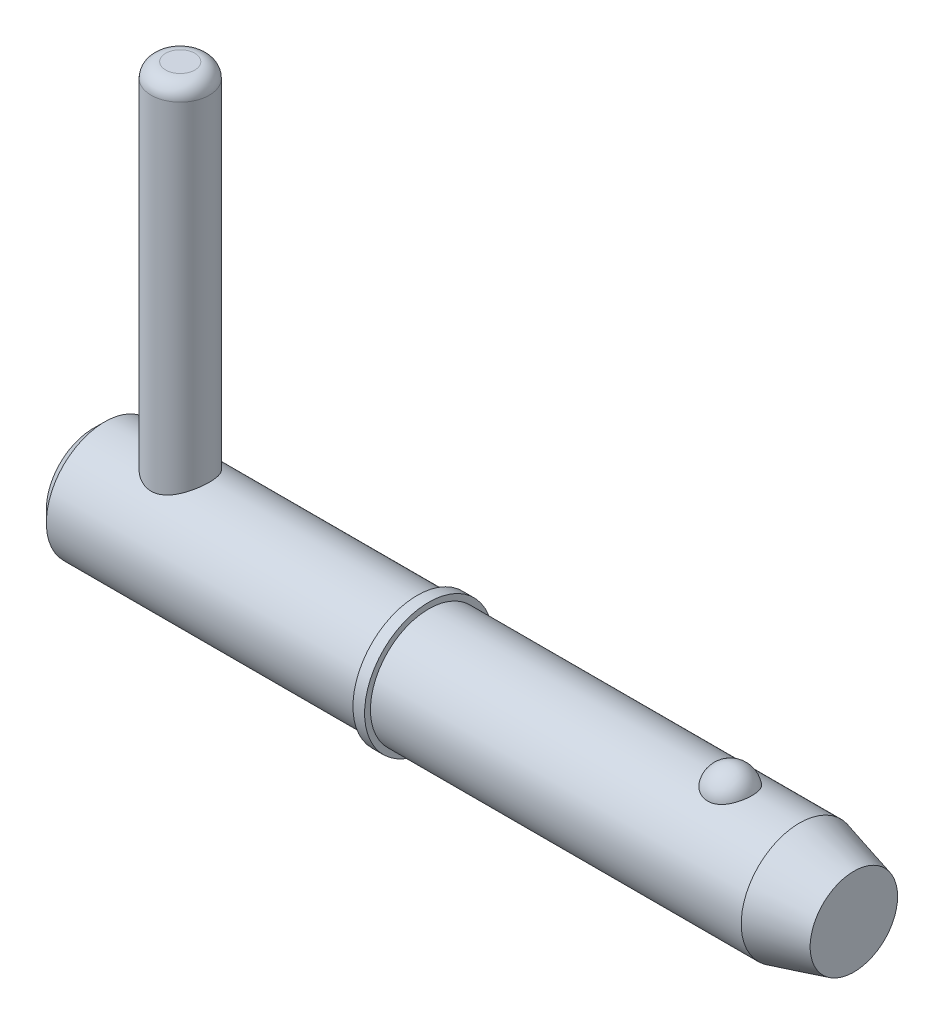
ISO-10303-21;
HEADER;
FILE_DESCRIPTION(('STEP AP214'),'2;1');
FILE_NAME('part.step','',(''),(''),'','','');
FILE_SCHEMA(('AUTOMOTIVE_DESIGN { 1 0 10303 214 1 1 1 1 }'));
ENDSEC;
DATA;
#1=APPLICATION_CONTEXT('core data for automotive mechanical design processes');
#2=APPLICATION_PROTOCOL_DEFINITION('international standard','automotive_design',2000,#1);
#3=PRODUCT_CONTEXT('',#1,'mechanical');
#4=PRODUCT('Part','Part','',(#3));
#5=PRODUCT_RELATED_PRODUCT_CATEGORY('part','',(#4));
#6=PRODUCT_DEFINITION_FORMATION('','',#4);
#7=PRODUCT_DEFINITION_CONTEXT('part definition',#1,'design');
#8=PRODUCT_DEFINITION('design','',#6,#7);
#9=PRODUCT_DEFINITION_SHAPE('','',#8);
#10=(LENGTH_UNIT() NAMED_UNIT(*) SI_UNIT(.MILLI.,.METRE.));
#11=(NAMED_UNIT(*) PLANE_ANGLE_UNIT() SI_UNIT($,.RADIAN.));
#12=(NAMED_UNIT(*) SI_UNIT($,.STERADIAN.) SOLID_ANGLE_UNIT());
#13=UNCERTAINTY_MEASURE_WITH_UNIT(LENGTH_MEASURE(1.E-05),#10,'distance_accuracy_value','');
#14=(GEOMETRIC_REPRESENTATION_CONTEXT(3) GLOBAL_UNCERTAINTY_ASSIGNED_CONTEXT((#13)) GLOBAL_UNIT_ASSIGNED_CONTEXT((#10,
#11,#12)) REPRESENTATION_CONTEXT('',''));
#15=CARTESIAN_POINT('',(0.,0.,0.));
#16=DIRECTION('',(0.,0.,1.));
#17=DIRECTION('',(1.,0.,0.));
#18=AXIS2_PLACEMENT_3D('',#15,#16,#17);
#19=CARTESIAN_POINT('',(4.755,22.225,0.));
#20=DIRECTION('',(0.,-1.,0.));
#21=DIRECTION('',(0.,0.,-1.));
#22=AXIS2_PLACEMENT_3D('',#19,#20,#21);
#23=CYLINDRICAL_SURFACE('',#22,1.585);
#24=CARTESIAN_POINT('',(4.755,-2.3825,0.));
#25=DIRECTION('',(0.,1.,0.));
#26=DIRECTION('',(0.,0.,1.));
#27=AXIS2_PLACEMENT_3D('',#24,#25,#26);
#28=CIRCLE('',#27,1.585);
#29=CARTESIAN_POINT('',(4.755,-2.3825,1.585));
#30=VERTEX_POINT('',#29);
#31=EDGE_CURVE('P0_E25',#30,#30,#28,.T.);
#32=ORIENTED_EDGE('',*,*,#31,.T.);
#33=EDGE_LOOP('',(#32));
#34=FACE_BOUND('',#33,.T.);
#35=CARTESIAN_POINT('',(4.755,21.4325,0.));
#36=DIRECTION('',(0.,1.,0.));
#37=DIRECTION('',(0.,0.,1.));
#38=AXIS2_PLACEMENT_3D('',#35,#36,#37);
#39=CIRCLE('',#38,1.585);
#40=CARTESIAN_POINT('',(4.755,21.4325,1.585));
#41=VERTEX_POINT('',#40);
#42=EDGE_CURVE('P0_E29',#41,#41,#39,.F.);
#43=ORIENTED_EDGE('',*,*,#42,.T.);
#44=EDGE_LOOP('',(#43));
#45=FACE_BOUND('',#44,.T.);
#46=ADVANCED_FACE('P0_F14',(#34,#45),#23,.T.);
#47=CARTESIAN_POINT('',(4.755,22.225,0.));
#48=DIRECTION('',(0.,1.,0.));
#49=DIRECTION('',(0.,0.,1.));
#50=AXIS2_PLACEMENT_3D('',#47,#48,#49);
#51=PLANE('',#50);
#52=CARTESIAN_POINT('',(4.755,22.225,0.));
#53=DIRECTION('',(0.,1.,0.));
#54=DIRECTION('',(0.,0.,1.));
#55=AXIS2_PLACEMENT_3D('',#52,#53,#54);
#56=CIRCLE('',#55,0.7925);
#57=CARTESIAN_POINT('',(4.755,22.225,0.7925));
#58=VERTEX_POINT('',#57);
#59=EDGE_CURVE('P0_E10',#58,#58,#56,.T.);
#60=ORIENTED_EDGE('',*,*,#59,.T.);
#61=EDGE_LOOP('',(#60));
#62=FACE_BOUND('',#61,.T.);
#63=ADVANCED_FACE('P0_F46',(#62),#51,.T.);
#64=CARTESIAN_POINT('',(4.755,-3.175,0.));
#65=DIRECTION('',(0.,1.,0.));
#66=DIRECTION('',(0.,0.,1.));
#67=AXIS2_PLACEMENT_3D('',#64,#65,#66);
#68=PLANE('',#67);
#69=CARTESIAN_POINT('',(4.755,-3.175,0.));
#70=DIRECTION('',(0.,1.,0.));
#71=DIRECTION('',(0.,0.,1.));
#72=AXIS2_PLACEMENT_3D('',#69,#70,#71);
#73=CIRCLE('',#72,0.7925);
#74=CARTESIAN_POINT('',(4.755,-3.175,0.7925));
#75=VERTEX_POINT('',#74);
#76=EDGE_CURVE('P0_E21',#75,#75,#73,.F.);
#77=ORIENTED_EDGE('',*,*,#76,.T.);
#78=EDGE_LOOP('',(#77));
#79=FACE_BOUND('',#78,.T.);
#80=ADVANCED_FACE('P0_F43',(#79),#68,.F.);
#81=CARTESIAN_POINT('',(4.755,-2.3825,0.));
#82=DIRECTION('',(0.,1.,0.));
#83=DIRECTION('',(0.,0.,1.));
#84=AXIS2_PLACEMENT_3D('',#81,#82,#83);
#85=DEGENERATE_TOROIDAL_SURFACE('',#84,0.7925,0.7925,.T.);
#86=ORIENTED_EDGE('',*,*,#76,.F.);
#87=EDGE_LOOP('',(#86));
#88=FACE_BOUND('',#87,.T.);
#89=ORIENTED_EDGE('',*,*,#31,.F.);
#90=EDGE_LOOP('',(#89));
#91=FACE_BOUND('',#90,.T.);
#92=ADVANCED_FACE('P0_F38',(#88,#91),#85,.T.);
#93=CARTESIAN_POINT('',(4.755,21.4325,0.));
#94=DIRECTION('',(0.,1.,0.));
#95=DIRECTION('',(0.,0.,1.));
#96=AXIS2_PLACEMENT_3D('',#93,#94,#95);
#97=DEGENERATE_TOROIDAL_SURFACE('',#96,0.7925,0.7925,.T.);
#98=ORIENTED_EDGE('',*,*,#42,.F.);
#99=EDGE_LOOP('',(#98));
#100=FACE_BOUND('',#99,.T.);
#101=ORIENTED_EDGE('',*,*,#59,.F.);
#102=EDGE_LOOP('',(#101));
#103=FACE_BOUND('',#102,.T.);
#104=ADVANCED_FACE('P0_F16',(#100,#103),#97,.T.);
#105=CLOSED_SHELL('',(#46,#63,#80,#92,#104));
#106=MANIFOLD_SOLID_BREP('P0_B1',#105);
#107=CARTESIAN_POINT('',(0.,0.,0.));
#108=DIRECTION('',(1.,0.,0.));
#109=DIRECTION('',(0.,0.,-1.));
#110=AXIS2_PLACEMENT_3D('',#107,#108,#109);
#111=CYLINDRICAL_SURFACE('',#110,3.175);
#112=CARTESIAN_POINT('',(38.4876846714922,0.,0.));
#113=DIRECTION('',(1.,0.,0.));
#114=DIRECTION('',(0.,0.,-1.));
#115=AXIS2_PLACEMENT_3D('',#112,#113,#114);
#116=CIRCLE('',#115,3.175);
#117=CARTESIAN_POINT('',(38.4876846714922,0.,-3.175));
#118=VERTEX_POINT('',#117);
#119=EDGE_CURVE('P1_E81',#118,#118,#116,.T.);
#120=ORIENTED_EDGE('',*,*,#119,.F.);
#121=EDGE_LOOP('',(#120));
#122=FACE_BOUND('',#121,.T.);
#123=CARTESIAN_POINT('',(18.29,0.,0.));
#124=DIRECTION('',(1.,0.,0.));
#125=DIRECTION('',(0.,0.,-1.));
#126=AXIS2_PLACEMENT_3D('',#123,#124,#125);
#127=CIRCLE('',#126,3.175);
#128=CARTESIAN_POINT('',(18.29,0.,-3.175));
#129=VERTEX_POINT('',#128);
#130=EDGE_CURVE('P1_E85',#129,#129,#127,.T.);
#131=ORIENTED_EDGE('',*,*,#130,.T.);
#132=EDGE_LOOP('',(#131));
#133=FACE_BOUND('',#132,.T.);
#134=CARTESIAN_POINT('',(34.7157276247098,2.92898950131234,1.22541646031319));
#135=CARTESIAN_POINT('',(34.652316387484,2.92899434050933,1.22541146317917));
#136=CARTESIAN_POINT('',(34.5887979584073,2.93112688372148,1.22034641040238));
#137=CARTESIAN_POINT('',(34.4635306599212,2.93942752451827,1.20020949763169));
#138=CARTESIAN_POINT('',(34.4017869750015,2.94560639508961,1.18511092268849));
#139=CARTESIAN_POINT('',(34.2820651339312,2.96127115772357,1.1454035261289));
#140=CARTESIAN_POINT('',(34.2240775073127,2.97074831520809,1.1208198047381));
#141=CARTESIAN_POINT('',(34.1131943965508,2.99197584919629,1.06285154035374));
#142=CARTESIAN_POINT('',(34.0602966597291,3.0037252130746,1.02947091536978));
#143=CARTESIAN_POINT('',(33.9592688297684,3.02865714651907,0.953674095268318));
#144=CARTESIAN_POINT('',(33.9113240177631,3.04187163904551,0.911021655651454));
#145=CARTESIAN_POINT('',(33.8230360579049,3.06808741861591,0.818400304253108));
#146=CARTESIAN_POINT('',(33.7826952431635,3.08108863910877,0.768429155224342));
#147=CARTESIAN_POINT('',(33.7088039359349,3.10614903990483,0.660064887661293));
#148=CARTESIAN_POINT('',(33.6756330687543,3.11814104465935,0.601396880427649));
#149=CARTESIAN_POINT('',(33.6191190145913,3.13926931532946,0.479026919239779));
#150=CARTESIAN_POINT('',(33.5957764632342,3.14840539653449,0.415324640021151));
#151=CARTESIAN_POINT('',(33.5591785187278,3.16298160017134,0.283885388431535));
#152=CARTESIAN_POINT('',(33.5460407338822,3.16837855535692,0.216110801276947));
#153=CARTESIAN_POINT('',(33.5305676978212,3.17475386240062,0.0791367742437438));
#154=CARTESIAN_POINT('',(33.528232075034,3.17573236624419,0.00993738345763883));
#155=CARTESIAN_POINT('',(33.5343886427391,3.17318075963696,-0.127420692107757));
#156=CARTESIAN_POINT('',(33.5428073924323,3.16968122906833,-0.195583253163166));
#157=CARTESIAN_POINT('',(33.5701752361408,3.1585790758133,-0.329413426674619));
#158=CARTESIAN_POINT('',(33.5891245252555,3.15097637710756,-0.395080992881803));
#159=CARTESIAN_POINT('',(33.6372057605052,3.13242485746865,-0.522180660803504));
#160=CARTESIAN_POINT('',(33.6663524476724,3.12147119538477,-0.583606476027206));
#161=CARTESIAN_POINT('',(33.7342352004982,3.09734973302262,-0.700436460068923));
#162=CARTESIAN_POINT('',(33.772972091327,3.08418174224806,-0.755840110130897));
#163=CARTESIAN_POINT('',(33.8594771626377,3.05694884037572,-0.85940454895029));
#164=CARTESIAN_POINT('',(33.9072961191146,3.04287919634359,-0.907521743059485));
#165=CARTESIAN_POINT('',(34.0107353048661,3.01548927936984,-0.994758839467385));
#166=CARTESIAN_POINT('',(34.0663549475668,3.0021689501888,-1.03387941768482));
#167=CARTESIAN_POINT('',(34.1828093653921,2.97810316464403,-1.10126594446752));
#168=CARTESIAN_POINT('',(34.2435182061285,2.96731170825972,-1.12973256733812));
#169=CARTESIAN_POINT('',(34.3693712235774,2.94928934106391,-1.17598467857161));
#170=CARTESIAN_POINT('',(34.4345137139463,2.94205708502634,-1.19377420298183));
#171=CARTESIAN_POINT('',(34.5638562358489,2.93233065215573,-1.21746387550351));
#172=CARTESIAN_POINT('',(34.6279385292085,2.92961621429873,-1.22391763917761));
#173=CARTESIAN_POINT('',(34.7563375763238,2.92855752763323,-1.22644976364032));
#174=CARTESIAN_POINT('',(34.8206542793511,2.93021238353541,-1.22253024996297));
#175=CARTESIAN_POINT('',(34.9455239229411,2.93756851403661,-1.20474140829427));
#176=CARTESIAN_POINT('',(35.006131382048,2.94313790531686,-1.1911962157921));
#177=CARTESIAN_POINT('',(35.1241106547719,2.95756226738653,-1.15491492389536));
#178=CARTESIAN_POINT('',(35.1814822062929,2.96641750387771,-1.13217808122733));
#179=CARTESIAN_POINT('',(35.2927699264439,2.98669918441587,-1.07755083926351));
#180=CARTESIAN_POINT('',(35.3465845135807,2.9981771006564,-1.04547308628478));
#181=CARTESIAN_POINT('',(35.4481473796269,3.02240235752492,-0.973220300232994));
#182=CARTESIAN_POINT('',(35.4958942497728,3.03514999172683,-0.933043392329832));
#183=CARTESIAN_POINT('',(35.5865817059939,3.06131230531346,-0.843372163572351));
#184=CARTESIAN_POINT('',(35.6291588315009,3.07472822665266,-0.793510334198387));
#185=CARTESIAN_POINT('',(35.7056765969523,3.10021106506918,-0.687241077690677));
#186=CARTESIAN_POINT('',(35.7396156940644,3.1122777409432,-0.630832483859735));
#187=CARTESIAN_POINT('',(35.7991209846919,3.134208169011,-0.511059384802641));
#188=CARTESIAN_POINT('',(35.8243892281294,3.14399040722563,-0.447531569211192));
#189=CARTESIAN_POINT('',(35.8645117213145,3.15983820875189,-0.316827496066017));
#190=CARTESIAN_POINT('',(35.8793659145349,3.16590375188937,-0.249651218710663));
#191=CARTESIAN_POINT('',(35.898358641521,3.17370076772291,-0.113549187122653));
#192=CARTESIAN_POINT('',(35.9024966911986,3.17543204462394,-0.044623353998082));
#193=CARTESIAN_POINT('',(35.8999697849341,3.17438372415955,0.0929938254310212));
#194=CARTESIAN_POINT('',(35.893305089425,3.17160423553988,0.161685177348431));
#195=CARTESIAN_POINT('',(35.8693754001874,3.1618438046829,0.296502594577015));
#196=CARTESIAN_POINT('',(35.8521674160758,3.15488546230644,0.36264043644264));
#197=CARTESIAN_POINT('',(35.807547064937,3.13748892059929,0.490896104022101));
#198=CARTESIAN_POINT('',(35.7801339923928,3.12705048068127,0.553013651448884));
#199=CARTESIAN_POINT('',(35.7154626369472,3.10369139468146,0.671876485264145));
#200=CARTESIAN_POINT('',(35.6781467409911,3.0907563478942,0.728587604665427));
#201=CARTESIAN_POINT('',(35.5945246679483,3.06381731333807,0.834653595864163));
#202=CARTESIAN_POINT('',(35.5482189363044,3.04981337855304,0.884008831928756));
#203=CARTESIAN_POINT('',(35.4477184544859,3.02230423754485,0.973916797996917));
#204=CARTESIAN_POINT('',(35.393535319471,3.00879833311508,1.01448227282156));
#205=CARTESIAN_POINT('',(35.2785299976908,2.98383625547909,1.08571550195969));
#206=CARTESIAN_POINT('',(35.2177053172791,2.97238085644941,1.11637952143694));
#207=CARTESIAN_POINT('',(35.0933690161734,2.95329063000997,1.16592590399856));
#208=CARTESIAN_POINT('',(35.0300230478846,2.94553738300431,1.1851790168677));
#209=CARTESIAN_POINT('',(34.9007664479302,2.9342556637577,1.21284802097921));
#210=CARTESIAN_POINT('',(34.8348641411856,2.93071450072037,1.22129647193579));
#211=CARTESIAN_POINT('',(34.751116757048,2.9291525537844,1.22502505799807));
#212=CARTESIAN_POINT('',(34.7334263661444,2.9289881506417,1.22541785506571));
#213=CARTESIAN_POINT('',(34.7157276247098,2.92898950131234,1.22541646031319));
#214=B_SPLINE_CURVE_WITH_KNOTS('',3,(#134,#135,#136,#137,#138,#139,#140,#141,#142,#143,#144,
#145,#146,#147,#148,#149,#150,#151,#152,#153,#154,#155,#156,#157,#158,#159,#160,#161,#162,#163,
#164,#165,#166,#167,#168,#169,#170,#171,#172,#173,#174,#175,#176,#177,#178,#179,#180,#181,#182,
#183,#184,#185,#186,#187,#188,#189,#190,#191,#192,#193,#194,#195,#196,#197,#198,#199,#200,#201,
#202,#203,#204,#205,#206,#207,#208,#209,#210,#211,#212,#213),.UNSPECIFIED.,.T.,.F.,(4,2,2,2,2,2,
2,2,2,2,2,2,2,2,2,2,2,2,2,2,2,2,2,2,2,2,2,2,2,2,2,2,2,2,2,2,2,2,2,4),(0.,0.190186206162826,
0.380880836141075,0.571074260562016,0.761183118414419,0.956866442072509,1.15260970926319,
1.35701770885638,1.56143892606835,1.76818248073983,1.9749189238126,2.18025109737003,
2.38558707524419,2.59122111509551,2.79687285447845,3.00371012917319,3.21053185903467,
3.41323429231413,3.61586005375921,3.80828192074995,4.00066436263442,4.18685798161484,
4.37306665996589,4.5633030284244,4.75358348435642,4.95345287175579,5.15335793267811,
5.3595700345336,5.56578325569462,5.77200579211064,5.97822335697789,6.18333558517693,
6.38846199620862,6.59480900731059,6.8011457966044,7.00718137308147,7.21329457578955,
7.41228022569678,7.61066481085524,7.6637477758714),.UNSPECIFIED.);
#215=CARTESIAN_POINT('',(34.7157276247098,2.92898950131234,1.22541646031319));
#216=VERTEX_POINT('',#215);
#217=EDGE_CURVE('P1_E35',#216,#216,#214,.T.);
#218=ORIENTED_EDGE('',*,*,#217,.T.);
#219=EDGE_LOOP('',(#218));
#220=FACE_BOUND('',#219,.T.);
#221=ADVANCED_FACE('P1_F13',(#122,#133,#220),#111,.T.);
#222=CARTESIAN_POINT('',(0.,0.,0.));
#223=DIRECTION('',(-1.,0.,0.));
#224=DIRECTION('',(0.,0.,1.));
#225=AXIS2_PLACEMENT_3D('',#222,#223,#224);
#226=PLANE('',#225);
#227=CARTESIAN_POINT('',(0.,0.,0.));
#228=DIRECTION('',(1.,0.,0.));
#229=DIRECTION('',(0.,0.,-1.));
#230=AXIS2_PLACEMENT_3D('',#227,#228,#229);
#231=CIRCLE('',#230,2.54);
#232=CARTESIAN_POINT('',(0.,0.,-2.54));
#233=VERTEX_POINT('',#232);
#234=EDGE_CURVE('P1_E9',#233,#233,#231,.T.);
#235=ORIENTED_EDGE('',*,*,#234,.F.);
#236=EDGE_LOOP('',(#235));
#237=FACE_BOUND('',#236,.T.);
#238=ADVANCED_FACE('P1_F15',(#237),#226,.T.);
#239=CARTESIAN_POINT('',(0.634999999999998,0.,0.));
#240=DIRECTION('',(1.,0.,0.));
#241=DIRECTION('',(0.,0.,-1.));
#242=AXIS2_PLACEMENT_3D('',#239,#240,#241);
#243=CONICAL_SURFACE('',#242,3.175,0.78539816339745);
#244=ORIENTED_EDGE('',*,*,#234,.T.);
#245=EDGE_LOOP('',(#244));
#246=FACE_BOUND('',#245,.T.);
#247=CARTESIAN_POINT('',(0.634999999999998,0.,0.));
#248=DIRECTION('',(1.,0.,0.));
#249=DIRECTION('',(0.,0.,-1.));
#250=AXIS2_PLACEMENT_3D('',#247,#248,#249);
#251=CIRCLE('',#250,3.175);
#252=CARTESIAN_POINT('',(0.634999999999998,0.,-3.175));
#253=VERTEX_POINT('',#252);
#254=EDGE_CURVE('P1_E26',#253,#253,#251,.T.);
#255=ORIENTED_EDGE('',*,*,#254,.F.);
#256=EDGE_LOOP('',(#255));
#257=FACE_BOUND('',#256,.T.);
#258=ADVANCED_FACE('P1_F77',(#246,#257),#243,.T.);
#259=CARTESIAN_POINT('',(0.,0.,0.));
#260=DIRECTION('',(1.,0.,0.));
#261=DIRECTION('',(0.,0.,-1.));
#262=AXIS2_PLACEMENT_3D('',#259,#260,#261);
#263=CYLINDRICAL_SURFACE('',#262,3.175);
#264=CARTESIAN_POINT('',(4.755,-2.75107251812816,1.585));
#265=CARTESIAN_POINT('',(4.67238891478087,-2.7510796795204,1.58499425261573));
#266=CARTESIAN_POINT('',(4.58967306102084,-2.75485010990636,1.57849830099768));
#267=CARTESIAN_POINT('',(4.42677850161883,-2.76938647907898,1.55284486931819));
#268=CARTESIAN_POINT('',(4.34660551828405,-2.78016716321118,1.53366069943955));
#269=CARTESIAN_POINT('',(4.19146029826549,-2.80716278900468,1.48366329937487));
#270=CARTESIAN_POINT('',(4.11646293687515,-2.8233488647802,1.45291173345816));
#271=CARTESIAN_POINT('',(3.97271079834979,-2.85928672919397,1.38084067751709));
#272=CARTESIAN_POINT('',(3.90395634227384,-2.87903870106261,1.33952064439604));
#273=CARTESIAN_POINT('',(3.76839976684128,-2.921867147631,1.24350234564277));
#274=CARTESIAN_POINT('',(3.702222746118,-2.94508343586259,1.18798355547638));
#275=CARTESIAN_POINT('',(3.5796334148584,-2.99109588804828,1.06685014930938));
#276=CARTESIAN_POINT('',(3.52322596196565,-3.01389183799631,1.00123054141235));
#277=CARTESIAN_POINT('',(3.41807024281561,-3.05832598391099,0.856373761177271));
#278=CARTESIAN_POINT('',(3.37009053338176,-3.07978367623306,0.776518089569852));
#279=CARTESIAN_POINT('',(3.28853137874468,-3.11730894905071,0.608596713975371));
#280=CARTESIAN_POINT('',(3.25494287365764,-3.1333799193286,0.520536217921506));
#281=CARTESIAN_POINT('',(3.20559401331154,-3.15731341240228,0.345327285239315));
#282=CARTESIAN_POINT('',(3.18873760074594,-3.16567752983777,0.258557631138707));
#283=CARTESIAN_POINT('',(3.16972238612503,-3.17512718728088,0.0830496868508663));
#284=CARTESIAN_POINT('',(3.16755472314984,-3.17621711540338,-0.00568738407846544));
#285=CARTESIAN_POINT('',(3.1775542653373,-3.17123385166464,-0.174372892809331));
#286=CARTESIAN_POINT('',(3.18849502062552,-3.16577346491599,-0.254416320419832));
#287=CARTESIAN_POINT('',(3.22220680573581,-3.14922844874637,-0.411354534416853));
#288=CARTESIAN_POINT('',(3.2449787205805,-3.13814339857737,-0.488249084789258));
#289=CARTESIAN_POINT('',(3.30185558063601,-3.111172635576,-0.638050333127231));
#290=CARTESIAN_POINT('',(3.33611332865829,-3.09522247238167,-0.710886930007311));
#291=CARTESIAN_POINT('',(3.41477890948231,-3.05996035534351,-0.849953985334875));
#292=CARTESIAN_POINT('',(3.45919037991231,-3.04064719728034,-0.916182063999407));
#293=CARTESIAN_POINT('',(3.5617148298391,-2.99832415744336,-1.04681642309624));
#294=CARTESIAN_POINT('',(3.62072497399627,-2.97513741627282,-1.11046186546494));
#295=CARTESIAN_POINT('',(3.7483697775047,-2.92885066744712,-1.22736291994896));
#296=CARTESIAN_POINT('',(3.81701173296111,-2.90575073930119,-1.2806105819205));
#297=CARTESIAN_POINT('',(3.96727993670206,-2.86067370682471,-1.37849835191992));
#298=CARTESIAN_POINT('',(4.04945242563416,-2.83885964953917,-1.42238246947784));
#299=CARTESIAN_POINT('',(4.2213558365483,-2.80110454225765,-1.49537418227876));
#300=CARTESIAN_POINT('',(4.3110787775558,-2.78515738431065,-1.52449715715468));
#301=CARTESIAN_POINT('',(4.48806324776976,-2.76271292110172,-1.56478065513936));
#302=CARTESIAN_POINT('',(4.57495732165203,-2.75556745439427,-1.57718067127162));
#303=CARTESIAN_POINT('',(4.74985771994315,-2.74969306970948,-1.58740564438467));
#304=CARTESIAN_POINT('',(4.8378632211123,-2.75095824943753,-1.58524082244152));
#305=CARTESIAN_POINT('',(5.00227282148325,-2.76107477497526,-1.56753530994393));
#306=CARTESIAN_POINT('',(5.07889680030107,-2.76908515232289,-1.55347662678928));
#307=CARTESIAN_POINT('',(5.22855309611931,-2.79054849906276,-1.51458035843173));
#308=CARTESIAN_POINT('',(5.30158424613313,-2.80400322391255,-1.489739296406));
#309=CARTESIAN_POINT('',(5.44583114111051,-2.83556995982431,-1.42877335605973));
#310=CARTESIAN_POINT('',(5.51680600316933,-2.85386886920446,-1.39217900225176));
#311=CARTESIAN_POINT('',(5.6520174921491,-2.89289503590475,-1.30915485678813));
#312=CARTESIAN_POINT('',(5.71625063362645,-2.91362353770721,-1.26272001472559));
#313=CARTESIAN_POINT('',(5.8445938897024,-2.95830220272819,-1.15451693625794));
#314=CARTESIAN_POINT('',(5.90767560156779,-2.98233004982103,-1.09155543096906));
#315=CARTESIAN_POINT('',(6.0226995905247,-3.02864458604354,-0.955560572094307));
#316=CARTESIAN_POINT('',(6.07463814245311,-3.05093069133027,-0.882523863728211));
#317=CARTESIAN_POINT('',(6.16704288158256,-3.09200671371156,-0.725836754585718));
#318=CARTESIAN_POINT('',(6.20717458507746,-3.11069030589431,-0.64195924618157));
#319=CARTESIAN_POINT('',(6.27235859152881,-3.1416474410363,-0.467442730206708));
#320=CARTESIAN_POINT('',(6.29742409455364,-3.15392659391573,-0.376809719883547));
#321=CARTESIAN_POINT('',(6.32960989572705,-3.16979844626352,-0.200314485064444));
#322=CARTESIAN_POINT('',(6.33816324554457,-3.17408359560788,-0.114775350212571));
#323=CARTESIAN_POINT('',(6.34130309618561,-3.17565001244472,0.0566108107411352));
#324=CARTESIAN_POINT('',(6.33589445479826,-3.17293371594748,0.142457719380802));
#325=CARTESIAN_POINT('',(6.31221457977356,-3.16120608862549,0.306097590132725));
#326=CARTESIAN_POINT('',(6.2948097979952,-3.15261910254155,0.38404960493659));
#327=CARTESIAN_POINT('',(6.24879775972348,-3.13040364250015,0.535801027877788));
#328=CARTESIAN_POINT('',(6.22018889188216,-3.11677444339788,0.609599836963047));
#329=CARTESIAN_POINT('',(6.15130303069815,-3.08497808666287,0.754502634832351));
#330=CARTESIAN_POINT('',(6.11057850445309,-3.0666414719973,0.82535556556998));
#331=CARTESIAN_POINT('',(6.01917980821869,-3.02735012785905,0.95951596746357));
#332=CARTESIAN_POINT('',(5.96850106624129,-3.00639419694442,1.02281994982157));
#333=CARTESIAN_POINT('',(5.8528006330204,-2.96149402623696,1.1467073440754));
#334=CARTESIAN_POINT('',(5.78685463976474,-2.93745961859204,1.20639723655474));
#335=CARTESIAN_POINT('',(5.64552278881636,-2.89084502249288,1.31419099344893));
#336=CARTESIAN_POINT('',(5.57012871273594,-2.8682661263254,1.36228466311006));
#337=CARTESIAN_POINT('',(5.40892145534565,-2.82661780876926,1.44677201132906));
#338=CARTESIAN_POINT('',(5.32285703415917,-2.80767948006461,1.48275497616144));
#339=CARTESIAN_POINT('',(5.14469010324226,-2.77716572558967,1.53916557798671));
#340=CARTESIAN_POINT('',(5.05260892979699,-2.76556569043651,1.55964525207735));
#341=CARTESIAN_POINT('',(4.92544162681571,-2.75613775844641,1.57618070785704));
#342=CARTESIAN_POINT('',(4.89147210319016,-2.75424493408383,1.57948285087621));
#343=CARTESIAN_POINT('',(4.82334103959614,-2.75171079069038,1.58389375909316));
#344=CARTESIAN_POINT('',(4.78917948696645,-2.75106955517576,1.58500237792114));
#345=CARTESIAN_POINT('',(4.755,-2.75107251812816,1.585));
#346=B_SPLINE_CURVE_WITH_KNOTS('',3,(#264,#265,#266,#267,#268,#269,#270,#271,#272,#273,#274,
#275,#276,#277,#278,#279,#280,#281,#282,#283,#284,#285,#286,#287,#288,#289,#290,#291,#292,#293,
#294,#295,#296,#297,#298,#299,#300,#301,#302,#303,#304,#305,#306,#307,#308,#309,#310,#311,#312,
#313,#314,#315,#316,#317,#318,#319,#320,#321,#322,#323,#324,#325,#326,#327,#328,#329,#330,#331,
#332,#333,#334,#335,#336,#337,#338,#339,#340,#341,#342,#343,#344,#345),.UNSPECIFIED.,.T.,.F.,(4,
2,2,2,2,2,2,2,2,2,2,2,2,2,2,2,2,2,2,2,2,2,2,2,2,2,2,2,2,2,2,2,2,2,2,2,2,2,2,2,4),(0.,
0.247689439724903,0.495901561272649,0.742808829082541,0.989728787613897,1.25694656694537,
1.52429683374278,1.80959781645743,2.0947189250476,2.35960564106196,2.62433255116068,
2.86610932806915,3.1079041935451,3.35305262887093,3.59828902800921,3.86665310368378,
4.13522157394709,4.4207514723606,4.70598326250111,4.9686344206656,5.23110127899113,
5.46499114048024,5.69895647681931,5.94376186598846,6.1886932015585,6.46438263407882,
6.74016408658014,7.0231370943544,7.30586181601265,7.5626977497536,7.81944433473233,
8.05935987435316,8.29930993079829,8.54954401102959,8.79989329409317,9.07508848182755,
9.35052473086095,9.63453318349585,9.91758407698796,10.0200561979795,10.1225351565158),.UNSPECIFIED.);
#347=CARTESIAN_POINT('',(4.755,-2.75107251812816,1.585));
#348=VERTEX_POINT('',#347);
#349=EDGE_CURVE('P1_E17',#348,#348,#346,.T.);
#350=ORIENTED_EDGE('',*,*,#349,.F.);
#351=EDGE_LOOP('',(#350));
#352=FACE_BOUND('',#351,.T.);
#353=CARTESIAN_POINT('',(4.755,2.75107251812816,1.585));
#354=CARTESIAN_POINT('',(4.83761108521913,2.7510796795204,1.58499425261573));
#355=CARTESIAN_POINT('',(4.92032693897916,2.75485010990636,1.57849830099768));
#356=CARTESIAN_POINT('',(5.08322149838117,2.76938647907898,1.55284486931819));
#357=CARTESIAN_POINT('',(5.16339448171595,2.78016716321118,1.53366069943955));
#358=CARTESIAN_POINT('',(5.31853970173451,2.80716278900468,1.48366329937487));
#359=CARTESIAN_POINT('',(5.39353706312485,2.8233488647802,1.45291173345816));
#360=CARTESIAN_POINT('',(5.53728920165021,2.85928672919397,1.38084067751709));
#361=CARTESIAN_POINT('',(5.60604365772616,2.87903870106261,1.33952064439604));
#362=CARTESIAN_POINT('',(5.74160023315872,2.921867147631,1.24350234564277));
#363=CARTESIAN_POINT('',(5.807777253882,2.94508343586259,1.18798355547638));
#364=CARTESIAN_POINT('',(5.9303665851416,2.99109588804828,1.06685014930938));
#365=CARTESIAN_POINT('',(5.98677403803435,3.01389183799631,1.00123054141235));
#366=CARTESIAN_POINT('',(6.09192975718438,3.05832598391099,0.85637376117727));
#367=CARTESIAN_POINT('',(6.13990946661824,3.07978367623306,0.776518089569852));
#368=CARTESIAN_POINT('',(6.22146862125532,3.11730894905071,0.608596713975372));
#369=CARTESIAN_POINT('',(6.25505712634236,3.1333799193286,0.520536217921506));
#370=CARTESIAN_POINT('',(6.30440598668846,3.15731341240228,0.345327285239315));
#371=CARTESIAN_POINT('',(6.32126239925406,3.16567752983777,0.258557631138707));
#372=CARTESIAN_POINT('',(6.34027761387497,3.17512718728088,0.0830496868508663));
#373=CARTESIAN_POINT('',(6.34244527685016,3.17621711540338,-0.00568738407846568));
#374=CARTESIAN_POINT('',(6.3324457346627,3.17123385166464,-0.174372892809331));
#375=CARTESIAN_POINT('',(6.32150497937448,3.16577346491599,-0.254416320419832));
#376=CARTESIAN_POINT('',(6.28779319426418,3.14922844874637,-0.411354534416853));
#377=CARTESIAN_POINT('',(6.2650212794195,3.13814339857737,-0.488249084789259));
#378=CARTESIAN_POINT('',(6.20814441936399,3.111172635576,-0.638050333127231));
#379=CARTESIAN_POINT('',(6.17388667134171,3.09522247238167,-0.710886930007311));
#380=CARTESIAN_POINT('',(6.09522109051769,3.05996035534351,-0.849953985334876));
#381=CARTESIAN_POINT('',(6.05080962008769,3.04064719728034,-0.916182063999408));
#382=CARTESIAN_POINT('',(5.9482851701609,2.99832415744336,-1.04681642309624));
#383=CARTESIAN_POINT('',(5.88927502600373,2.97513741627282,-1.11046186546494));
#384=CARTESIAN_POINT('',(5.7616302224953,2.92885066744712,-1.22736291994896));
#385=CARTESIAN_POINT('',(5.69298826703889,2.90575073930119,-1.2806105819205));
#386=CARTESIAN_POINT('',(5.54272006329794,2.86067370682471,-1.37849835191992));
#387=CARTESIAN_POINT('',(5.46054757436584,2.83885964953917,-1.42238246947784));
#388=CARTESIAN_POINT('',(5.2886441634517,2.80110454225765,-1.49537418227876));
#389=CARTESIAN_POINT('',(5.19892122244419,2.78515738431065,-1.52449715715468));
#390=CARTESIAN_POINT('',(5.02193675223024,2.76271292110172,-1.56478065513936));
#391=CARTESIAN_POINT('',(4.93504267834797,2.75556745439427,-1.57718067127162));
#392=CARTESIAN_POINT('',(4.76014228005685,2.74969306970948,-1.58740564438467));
#393=CARTESIAN_POINT('',(4.6721367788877,2.75095824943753,-1.58524082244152));
#394=CARTESIAN_POINT('',(4.50772717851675,2.76107477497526,-1.56753530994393));
#395=CARTESIAN_POINT('',(4.43110319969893,2.76908515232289,-1.55347662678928));
#396=CARTESIAN_POINT('',(4.28144690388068,2.79054849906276,-1.51458035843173));
#397=CARTESIAN_POINT('',(4.20841575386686,2.80400322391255,-1.489739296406));
#398=CARTESIAN_POINT('',(4.06416885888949,2.83556995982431,-1.42877335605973));
#399=CARTESIAN_POINT('',(3.99319399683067,2.85386886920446,-1.39217900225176));
#400=CARTESIAN_POINT('',(3.8579825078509,2.89289503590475,-1.30915485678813));
#401=CARTESIAN_POINT('',(3.79374936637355,2.91362353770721,-1.26272001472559));
#402=CARTESIAN_POINT('',(3.6654061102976,2.95830220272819,-1.15451693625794));
#403=CARTESIAN_POINT('',(3.60232439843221,2.98233004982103,-1.09155543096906));
#404=CARTESIAN_POINT('',(3.4873004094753,3.02864458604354,-0.955560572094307));
#405=CARTESIAN_POINT('',(3.43536185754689,3.05093069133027,-0.88252386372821));
#406=CARTESIAN_POINT('',(3.34295711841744,3.09200671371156,-0.725836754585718));
#407=CARTESIAN_POINT('',(3.30282541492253,3.11069030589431,-0.64195924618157));
#408=CARTESIAN_POINT('',(3.23764140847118,3.14164744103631,-0.467442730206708));
#409=CARTESIAN_POINT('',(3.21257590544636,3.15392659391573,-0.376809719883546));
#410=CARTESIAN_POINT('',(3.18039010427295,3.16979844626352,-0.200314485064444));
#411=CARTESIAN_POINT('',(3.17183675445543,3.17408359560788,-0.114775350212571));
#412=CARTESIAN_POINT('',(3.16869690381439,3.17565001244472,0.0566108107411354));
#413=CARTESIAN_POINT('',(3.17410554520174,3.17293371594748,0.142457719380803));
#414=CARTESIAN_POINT('',(3.19778542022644,3.16120608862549,0.306097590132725));
#415=CARTESIAN_POINT('',(3.2151902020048,3.15261910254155,0.384049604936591));
#416=CARTESIAN_POINT('',(3.26120224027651,3.13040364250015,0.535801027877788));
#417=CARTESIAN_POINT('',(3.28981110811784,3.11677444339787,0.609599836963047));
#418=CARTESIAN_POINT('',(3.35869696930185,3.08497808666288,0.754502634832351));
#419=CARTESIAN_POINT('',(3.39942149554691,3.0666414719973,0.82535556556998));
#420=CARTESIAN_POINT('',(3.49082019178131,3.02735012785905,0.95951596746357));
#421=CARTESIAN_POINT('',(3.54149893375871,3.00639419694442,1.02281994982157));
#422=CARTESIAN_POINT('',(3.6571993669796,2.96149402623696,1.1467073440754));
#423=CARTESIAN_POINT('',(3.72314536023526,2.93745961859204,1.20639723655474));
#424=CARTESIAN_POINT('',(3.86447721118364,2.89084502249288,1.31419099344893));
#425=CARTESIAN_POINT('',(3.93987128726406,2.8682661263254,1.36228466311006));
#426=CARTESIAN_POINT('',(4.10107854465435,2.82661780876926,1.44677201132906));
#427=CARTESIAN_POINT('',(4.18714296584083,2.80767948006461,1.48275497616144));
#428=CARTESIAN_POINT('',(4.36530989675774,2.77716572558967,1.53916557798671));
#429=CARTESIAN_POINT('',(4.45739107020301,2.76556569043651,1.55964525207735));
#430=CARTESIAN_POINT('',(4.58455837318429,2.75613775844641,1.57618070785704));
#431=CARTESIAN_POINT('',(4.61852789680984,2.75424493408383,1.57948285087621));
#432=CARTESIAN_POINT('',(4.68665896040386,2.75171079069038,1.58389375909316));
#433=CARTESIAN_POINT('',(4.72082051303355,2.75106955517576,1.58500237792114));
#434=CARTESIAN_POINT('',(4.755,2.75107251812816,1.585));
#435=B_SPLINE_CURVE_WITH_KNOTS('',3,(#353,#354,#355,#356,#357,#358,#359,#360,#361,#362,#363,
#364,#365,#366,#367,#368,#369,#370,#371,#372,#373,#374,#375,#376,#377,#378,#379,#380,#381,#382,
#383,#384,#385,#386,#387,#388,#389,#390,#391,#392,#393,#394,#395,#396,#397,#398,#399,#400,#401,
#402,#403,#404,#405,#406,#407,#408,#409,#410,#411,#412,#413,#414,#415,#416,#417,#418,#419,#420,
#421,#422,#423,#424,#425,#426,#427,#428,#429,#430,#431,#432,#433,#434),.UNSPECIFIED.,.T.,.F.,(4,
2,2,2,2,2,2,2,2,2,2,2,2,2,2,2,2,2,2,2,2,2,2,2,2,2,2,2,2,2,2,2,2,2,2,2,2,2,2,2,4),(0.,
0.247689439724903,0.495901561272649,0.742808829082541,0.989728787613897,1.25694656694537,
1.52429683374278,1.80959781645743,2.0947189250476,2.35960564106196,2.62433255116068,
2.86610932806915,3.1079041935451,3.35305262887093,3.59828902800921,3.86665310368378,
4.13522157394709,4.4207514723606,4.70598326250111,4.9686344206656,5.23110127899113,
5.46499114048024,5.69895647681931,5.94376186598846,6.1886932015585,6.46438263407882,
6.74016408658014,7.0231370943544,7.30586181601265,7.5626977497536,7.81944433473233,
8.05935987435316,8.29930993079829,8.54954401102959,8.79989329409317,9.07508848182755,
9.35052473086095,9.63453318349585,9.91758407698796,10.0200561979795,10.1225351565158),.UNSPECIFIED.);
#436=CARTESIAN_POINT('',(4.755,2.75107251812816,1.585));
#437=VERTEX_POINT('',#436);
#438=EDGE_CURVE('P1_E43',#437,#437,#435,.T.);
#439=ORIENTED_EDGE('',*,*,#438,.F.);
#440=EDGE_LOOP('',(#439));
#441=FACE_BOUND('',#440,.T.);
#442=ORIENTED_EDGE('',*,*,#254,.T.);
#443=EDGE_LOOP('',(#442));
#444=FACE_BOUND('',#443,.T.);
#445=CARTESIAN_POINT('',(17.655,0.,0.));
#446=DIRECTION('',(1.,0.,0.));
#447=DIRECTION('',(0.,0.,-1.));
#448=AXIS2_PLACEMENT_3D('',#445,#446,#447);
#449=CIRCLE('',#448,3.175);
#450=CARTESIAN_POINT('',(17.655,0.,-3.175));
#451=VERTEX_POINT('',#450);
#452=EDGE_CURVE('P1_E31',#451,#451,#449,.T.);
#453=ORIENTED_EDGE('',*,*,#452,.F.);
#454=EDGE_LOOP('',(#453));
#455=FACE_BOUND('',#454,.T.);
#456=ADVANCED_FACE('P1_F103',(#352,#441,#444,#455),#263,.T.);
#457=CARTESIAN_POINT('',(17.655,3.175,0.));
#458=DIRECTION('',(-1.,0.,0.));
#459=DIRECTION('',(0.,0.,1.));
#460=AXIS2_PLACEMENT_3D('',#457,#458,#459);
#461=PLANE('',#460);
#462=ORIENTED_EDGE('',*,*,#452,.T.);
#463=EDGE_LOOP('',(#462));
#464=FACE_BOUND('',#463,.T.);
#465=CARTESIAN_POINT('',(17.655,0.,0.));
#466=DIRECTION('',(1.,0.,0.));
#467=DIRECTION('',(0.,0.,-1.));
#468=AXIS2_PLACEMENT_3D('',#465,#466,#467);
#469=CIRCLE('',#468,3.4925);
#470=CARTESIAN_POINT('',(17.655,0.,-3.4925));
#471=VERTEX_POINT('',#470);
#472=EDGE_CURVE('P1_E91',#471,#471,#469,.T.);
#473=ORIENTED_EDGE('',*,*,#472,.F.);
#474=EDGE_LOOP('',(#473));
#475=FACE_BOUND('',#474,.T.);
#476=ADVANCED_FACE('P1_F100',(#464,#475),#461,.T.);
#477=CARTESIAN_POINT('',(0.,0.,0.));
#478=DIRECTION('',(1.,0.,0.));
#479=DIRECTION('',(0.,0.,-1.));
#480=AXIS2_PLACEMENT_3D('',#477,#478,#479);
#481=CYLINDRICAL_SURFACE('',#480,3.4925);
#482=ORIENTED_EDGE('',*,*,#472,.T.);
#483=EDGE_LOOP('',(#482));
#484=FACE_BOUND('',#483,.T.);
#485=CARTESIAN_POINT('',(18.29,0.,0.));
#486=DIRECTION('',(1.,0.,0.));
#487=DIRECTION('',(0.,0.,-1.));
#488=AXIS2_PLACEMENT_3D('',#485,#486,#487);
#489=CIRCLE('',#488,3.4925);
#490=CARTESIAN_POINT('',(18.29,0.,-3.4925));
#491=VERTEX_POINT('',#490);
#492=EDGE_CURVE('P1_E88',#491,#491,#489,.T.);
#493=ORIENTED_EDGE('',*,*,#492,.F.);
#494=EDGE_LOOP('',(#493));
#495=FACE_BOUND('',#494,.T.);
#496=ADVANCED_FACE('P1_F68',(#484,#495),#481,.T.);
#497=CARTESIAN_POINT('',(18.29,3.4925,0.));
#498=DIRECTION('',(1.,0.,0.));
#499=DIRECTION('',(0.,0.,-1.));
#500=AXIS2_PLACEMENT_3D('',#497,#498,#499);
#501=PLANE('',#500);
#502=ORIENTED_EDGE('',*,*,#492,.T.);
#503=EDGE_LOOP('',(#502));
#504=FACE_BOUND('',#503,.T.);
#505=ORIENTED_EDGE('',*,*,#130,.F.);
#506=EDGE_LOOP('',(#505));
#507=FACE_BOUND('',#506,.T.);
#508=ADVANCED_FACE('P1_F62',(#504,#507),#501,.T.);
#509=CARTESIAN_POINT('',(41.45,0.,0.));
#510=DIRECTION('',(-1.,0.,0.));
#511=DIRECTION('',(0.,0.,1.));
#512=AXIS2_PLACEMENT_3D('',#509,#510,#511);
#513=CONICAL_SURFACE('',#512,2.38125,0.26179938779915);
#514=ORIENTED_EDGE('',*,*,#119,.T.);
#515=EDGE_LOOP('',(#514));
#516=FACE_BOUND('',#515,.T.);
#517=CARTESIAN_POINT('',(41.45,0.,0.));
#518=DIRECTION('',(1.,0.,0.));
#519=DIRECTION('',(0.,0.,-1.));
#520=AXIS2_PLACEMENT_3D('',#517,#518,#519);
#521=CIRCLE('',#520,2.38125);
#522=CARTESIAN_POINT('',(41.45,0.,-2.38125));
#523=VERTEX_POINT('',#522);
#524=EDGE_CURVE('P1_E42',#523,#523,#521,.T.);
#525=ORIENTED_EDGE('',*,*,#524,.F.);
#526=EDGE_LOOP('',(#525));
#527=FACE_BOUND('',#526,.T.);
#528=ADVANCED_FACE('P1_F59',(#516,#527),#513,.T.);
#529=CARTESIAN_POINT('',(41.45,2.38125,0.));
#530=DIRECTION('',(1.,0.,0.));
#531=DIRECTION('',(0.,0.,-1.));
#532=AXIS2_PLACEMENT_3D('',#529,#530,#531);
#533=PLANE('',#532);
#534=ORIENTED_EDGE('',*,*,#524,.T.);
#535=EDGE_LOOP('',(#534));
#536=FACE_BOUND('',#535,.T.);
#537=ADVANCED_FACE('P1_F55',(#536),#533,.T.);
#538=CARTESIAN_POINT('',(34.7157276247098,2.8575,0.));
#539=DIRECTION('',(-1.,0.,0.));
#540=DIRECTION('',(0.,1.,0.));
#541=AXIS2_PLACEMENT_3D('',#538,#539,#540);
#542=SPHERICAL_SURFACE('',#541,1.22749999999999);
#543=ORIENTED_EDGE('',*,*,#217,.F.);
#544=EDGE_LOOP('',(#543));
#545=FACE_BOUND('',#544,.T.);
#546=ADVANCED_FACE('P1_F50',(#545),#542,.T.);
#547=CARTESIAN_POINT('',(4.755,-3.4925,0.));
#548=DIRECTION('',(0.,1.,0.));
#549=DIRECTION('',(0.,0.,1.));
#550=AXIS2_PLACEMENT_3D('',#547,#548,#549);
#551=CYLINDRICAL_SURFACE('',#550,1.585);
#552=ORIENTED_EDGE('',*,*,#349,.T.);
#553=EDGE_LOOP('',(#552));
#554=FACE_BOUND('',#553,.T.);
#555=ORIENTED_EDGE('',*,*,#438,.T.);
#556=EDGE_LOOP('',(#555));
#557=FACE_BOUND('',#556,.T.);
#558=ADVANCED_FACE('P1_F54',(#554,#557),#551,.F.);
#559=CLOSED_SHELL('',(#221,#238,#258,#456,#476,#496,#508,#528,#537,#546,#558));
#560=MANIFOLD_SOLID_BREP('P1_B1',#559);
#561=ADVANCED_BREP_SHAPE_REPRESENTATION('',(#18,#106,#560),#14);
#562=SHAPE_DEFINITION_REPRESENTATION(#9,#561);
ENDSEC;
END-ISO-10303-21;
